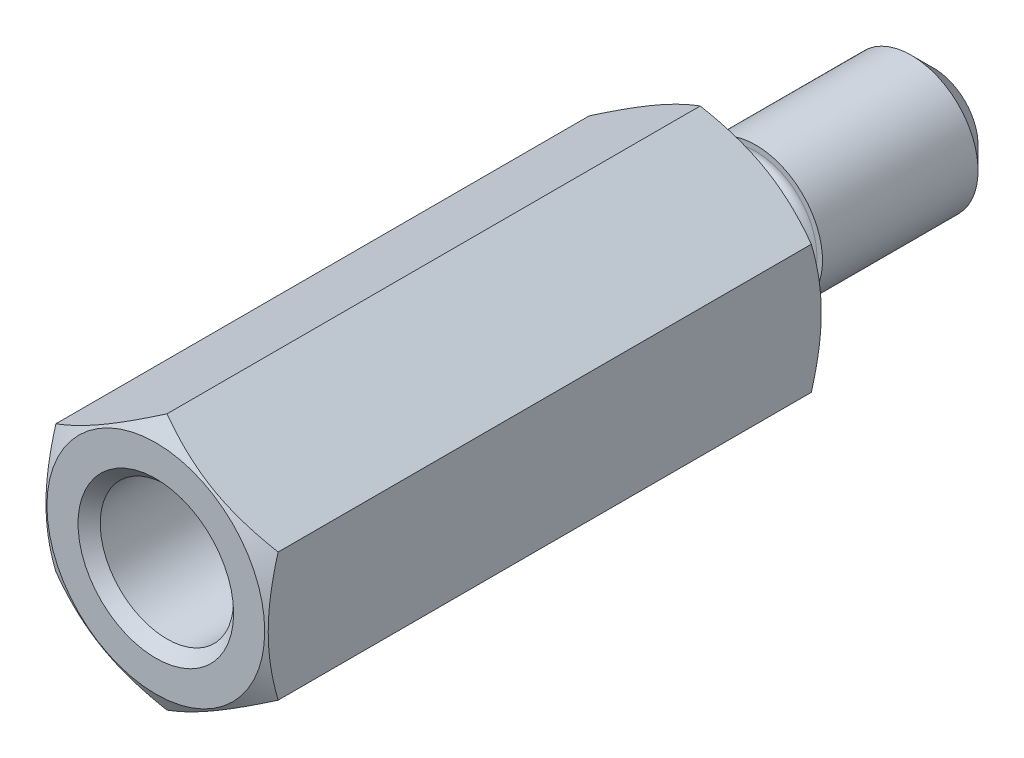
ISO-10303-21;
HEADER;
FILE_DESCRIPTION(('STEP AP214'),'2;1');
FILE_NAME('part.step','',(''),(''),'','','');
FILE_SCHEMA(('AUTOMOTIVE_DESIGN { 1 0 10303 214 1 1 1 1 }'));
ENDSEC;
DATA;
#1=APPLICATION_CONTEXT('core data for automotive mechanical design processes');
#2=APPLICATION_PROTOCOL_DEFINITION('international standard','automotive_design',2000,#1);
#3=PRODUCT_CONTEXT('',#1,'mechanical');
#4=PRODUCT('Part','Part','',(#3));
#5=PRODUCT_RELATED_PRODUCT_CATEGORY('part','',(#4));
#6=PRODUCT_DEFINITION_FORMATION('','',#4);
#7=PRODUCT_DEFINITION_CONTEXT('part definition',#1,'design');
#8=PRODUCT_DEFINITION('design','',#6,#7);
#9=PRODUCT_DEFINITION_SHAPE('','',#8);
#10=(LENGTH_UNIT() NAMED_UNIT(*) SI_UNIT(.MILLI.,.METRE.));
#11=(NAMED_UNIT(*) PLANE_ANGLE_UNIT() SI_UNIT($,.RADIAN.));
#12=(NAMED_UNIT(*) SI_UNIT($,.STERADIAN.) SOLID_ANGLE_UNIT());
#13=UNCERTAINTY_MEASURE_WITH_UNIT(LENGTH_MEASURE(1.E-05),#10,'distance_accuracy_value','');
#14=(GEOMETRIC_REPRESENTATION_CONTEXT(3) GLOBAL_UNCERTAINTY_ASSIGNED_CONTEXT((#13)) GLOBAL_UNIT_ASSIGNED_CONTEXT((#10,
#11,#12)) REPRESENTATION_CONTEXT('',''));
#15=CARTESIAN_POINT('',(0.,0.,0.));
#16=DIRECTION('',(0.,0.,1.));
#17=DIRECTION('',(1.,0.,0.));
#18=AXIS2_PLACEMENT_3D('',#15,#16,#17);
#19=CARTESIAN_POINT('',(0.,-5.77350269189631,0.));
#20=DIRECTION('',(0.,0.,-1.));
#21=DIRECTION('',(-1.,0.,0.));
#22=AXIS2_PLACEMENT_3D('',#19,#20,#21);
#23=PLANE('',#22);
#24=CARTESIAN_POINT('',(0.,0.,0.));
#25=DIRECTION('',(0.,0.,-1.));
#26=DIRECTION('',(-1.,0.,0.));
#27=AXIS2_PLACEMENT_3D('',#24,#25,#26);
#28=CIRCLE('',#27,2.75);
#29=CARTESIAN_POINT('',(-2.75,0.,0.));
#30=VERTEX_POINT('',#29);
#31=EDGE_CURVE('E23',#30,#30,#28,.F.);
#32=ORIENTED_EDGE('',*,*,#31,.T.);
#33=EDGE_LOOP('',(#32));
#34=FACE_BOUND('',#33,.T.);
#35=CARTESIAN_POINT('',(0.,0.,0.));
#36=DIRECTION('',(0.,0.,-1.));
#37=DIRECTION('',(-1.,0.,0.));
#38=AXIS2_PLACEMENT_3D('',#35,#36,#37);
#39=CIRCLE('',#38,4.9);
#40=CARTESIAN_POINT('',(-4.9,0.,0.));
#41=VERTEX_POINT('',#40);
#42=EDGE_CURVE('E73',#41,#41,#39,.T.);
#43=ORIENTED_EDGE('',*,*,#42,.T.);
#44=EDGE_LOOP('',(#43));
#45=FACE_BOUND('',#44,.T.);
#46=ADVANCED_FACE('F14',(#34,#45),#23,.T.);
#47=CARTESIAN_POINT('',(0.,0.,-10.));
#48=DIRECTION('',(0.,0.,1.));
#49=DIRECTION('',(1.,0.,0.));
#50=AXIS2_PLACEMENT_3D('',#47,#48,#49);
#51=CYLINDRICAL_SURFACE('',#50,3.);
#52=CARTESIAN_POINT('',(0.,0.,-2.));
#53=DIRECTION('',(0.,0.,-1.));
#54=DIRECTION('',(-1.,0.,0.));
#55=AXIS2_PLACEMENT_3D('',#52,#53,#54);
#56=CIRCLE('',#55,3.);
#57=CARTESIAN_POINT('',(-3.,0.,-2.));
#58=VERTEX_POINT('',#57);
#59=EDGE_CURVE('E233',#58,#58,#56,.T.);
#60=ORIENTED_EDGE('',*,*,#59,.T.);
#61=EDGE_LOOP('',(#60));
#62=FACE_BOUND('',#61,.T.);
#63=CARTESIAN_POINT('',(0.,0.,-9.));
#64=DIRECTION('',(0.,0.,-1.));
#65=DIRECTION('',(-1.,0.,0.));
#66=AXIS2_PLACEMENT_3D('',#63,#64,#65);
#67=CIRCLE('',#66,3.);
#68=CARTESIAN_POINT('',(-3.,0.,-9.));
#69=VERTEX_POINT('',#68);
#70=EDGE_CURVE('E85',#69,#69,#67,.F.);
#71=ORIENTED_EDGE('',*,*,#70,.T.);
#72=EDGE_LOOP('',(#71));
#73=FACE_BOUND('',#72,.T.);
#74=ADVANCED_FACE('F209',(#62,#73),#51,.T.);
#75=CARTESIAN_POINT('',(0.,0.,-10.));
#76=DIRECTION('',(0.,0.,-1.));
#77=DIRECTION('',(-1.,0.,0.));
#78=AXIS2_PLACEMENT_3D('',#75,#76,#77);
#79=PLANE('',#78);
#80=CARTESIAN_POINT('',(0.,0.,-10.));
#81=DIRECTION('',(0.,0.,-1.));
#82=DIRECTION('',(-1.,0.,0.));
#83=AXIS2_PLACEMENT_3D('',#80,#81,#82);
#84=CIRCLE('',#83,2.);
#85=CARTESIAN_POINT('',(-2.,0.,-10.));
#86=VERTEX_POINT('',#85);
#87=EDGE_CURVE('E82',#86,#86,#84,.T.);
#88=ORIENTED_EDGE('',*,*,#87,.T.);
#89=EDGE_LOOP('',(#88));
#90=FACE_BOUND('',#89,.T.);
#91=ADVANCED_FACE('F213',(#90),#79,.T.);
#92=CARTESIAN_POINT('',(0.,0.,-10.));
#93=DIRECTION('',(0.,0.,1.));
#94=DIRECTION('',(1.,0.,0.));
#95=AXIS2_PLACEMENT_3D('',#92,#93,#94);
#96=CONICAL_SURFACE('',#95,2.,0.78539816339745);
#97=ORIENTED_EDGE('',*,*,#70,.F.);
#98=EDGE_LOOP('',(#97));
#99=FACE_BOUND('',#98,.T.);
#100=ORIENTED_EDGE('',*,*,#87,.F.);
#101=EDGE_LOOP('',(#100));
#102=FACE_BOUND('',#101,.T.);
#103=ADVANCED_FACE('F216',(#99,#102),#96,.T.);
#104=CARTESIAN_POINT('',(0.,0.,-2.));
#105=DIRECTION('',(0.,0.,-1.));
#106=DIRECTION('',(-1.,0.,0.));
#107=AXIS2_PLACEMENT_3D('',#104,#105,#106);
#108=PLANE('',#107);
#109=CARTESIAN_POINT('',(0.,0.,-2.));
#110=DIRECTION('',(0.,0.,-1.));
#111=DIRECTION('',(-1.,0.,0.));
#112=AXIS2_PLACEMENT_3D('',#109,#110,#111);
#113=CIRCLE('',#112,2.75);
#114=CARTESIAN_POINT('',(-2.75,0.,-2.));
#115=VERTEX_POINT('',#114);
#116=EDGE_CURVE('E93',#115,#115,#113,.T.);
#117=ORIENTED_EDGE('',*,*,#116,.T.);
#118=EDGE_LOOP('',(#117));
#119=FACE_BOUND('',#118,.T.);
#120=ORIENTED_EDGE('',*,*,#59,.F.);
#121=EDGE_LOOP('',(#120));
#122=FACE_BOUND('',#121,.T.);
#123=ADVANCED_FACE('F218',(#119,#122),#108,.F.);
#124=CARTESIAN_POINT('',(0.,0.,-2.));
#125=DIRECTION('',(0.,0.,1.));
#126=DIRECTION('',(1.,0.,0.));
#127=AXIS2_PLACEMENT_3D('',#124,#125,#126);
#128=CYLINDRICAL_SURFACE('',#127,2.35);
#129=CARTESIAN_POINT('',(0.,0.,-1.6));
#130=DIRECTION('',(0.,0.,-1.));
#131=DIRECTION('',(-1.,0.,0.));
#132=AXIS2_PLACEMENT_3D('',#129,#130,#131);
#133=CIRCLE('',#132,2.35);
#134=CARTESIAN_POINT('',(-2.35,0.,-1.6));
#135=VERTEX_POINT('',#134);
#136=EDGE_CURVE('E99',#135,#135,#133,.F.);
#137=ORIENTED_EDGE('',*,*,#136,.T.);
#138=EDGE_LOOP('',(#137));
#139=FACE_BOUND('',#138,.T.);
#140=CARTESIAN_POINT('',(0.,0.,-0.4));
#141=DIRECTION('',(0.,0.,-1.));
#142=DIRECTION('',(-1.,0.,0.));
#143=AXIS2_PLACEMENT_3D('',#140,#141,#142);
#144=CIRCLE('',#143,2.35);
#145=CARTESIAN_POINT('',(-2.35,0.,-0.4));
#146=VERTEX_POINT('',#145);
#147=EDGE_CURVE('E96',#146,#146,#144,.T.);
#148=ORIENTED_EDGE('',*,*,#147,.T.);
#149=EDGE_LOOP('',(#148));
#150=FACE_BOUND('',#149,.T.);
#151=ADVANCED_FACE('F121',(#139,#150),#128,.T.);
#152=CARTESIAN_POINT('',(0.,0.,-1.6));
#153=DIRECTION('',(0.,0.,-1.));
#154=DIRECTION('',(-1.,0.,0.));
#155=AXIS2_PLACEMENT_3D('',#152,#153,#154);
#156=TOROIDAL_SURFACE('',#155,2.75,0.4);
#157=ORIENTED_EDGE('',*,*,#136,.F.);
#158=EDGE_LOOP('',(#157));
#159=FACE_BOUND('',#158,.T.);
#160=ORIENTED_EDGE('',*,*,#116,.F.);
#161=EDGE_LOOP('',(#160));
#162=FACE_BOUND('',#161,.T.);
#163=ADVANCED_FACE('F226',(#159,#162),#156,.F.);
#164=CARTESIAN_POINT('',(0.,0.,-0.4));
#165=DIRECTION('',(0.,0.,-1.));
#166=DIRECTION('',(-1.,0.,0.));
#167=AXIS2_PLACEMENT_3D('',#164,#165,#166);
#168=TOROIDAL_SURFACE('',#167,2.75,0.4);
#169=ORIENTED_EDGE('',*,*,#31,.F.);
#170=EDGE_LOOP('',(#169));
#171=FACE_BOUND('',#170,.T.);
#172=ORIENTED_EDGE('',*,*,#147,.F.);
#173=EDGE_LOOP('',(#172));
#174=FACE_BOUND('',#173,.T.);
#175=ADVANCED_FACE('F16',(#171,#174),#168,.F.);
#176=CARTESIAN_POINT('',(0.,0.,0.));
#177=DIRECTION('',(0.,0.,1.));
#178=DIRECTION('',(-1.,0.,0.));
#179=AXIS2_PLACEMENT_3D('',#176,#177,#178);
#180=CONICAL_SURFACE('',#179,4.9,1.0471975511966);
#181=ORIENTED_EDGE('',*,*,#42,.F.);
#182=EDGE_LOOP('',(#181));
#183=FACE_BOUND('',#182,.T.);
#184=CARTESIAN_POINT('',(5.,-28.6841070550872,13.9814764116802));
#185=CARTESIAN_POINT('',(4.99999999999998,-27.7942227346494,13.4753731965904));
#186=CARTESIAN_POINT('',(4.99999999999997,-26.904071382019,12.9697376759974));
#187=CARTESIAN_POINT('',(4.99999999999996,-25.1220022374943,11.9593311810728));
#188=CARTESIAN_POINT('',(4.99999999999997,-24.2300835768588,11.45456173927));
#189=CARTESIAN_POINT('',(4.99999999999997,-22.4259704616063,10.4360738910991));
#190=CARTESIAN_POINT('',(4.99999999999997,-21.5137527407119,9.92239667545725));
#191=CARTESIAN_POINT('',(4.99999999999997,-19.6887187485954,8.89842998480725));
#192=CARTESIAN_POINT('',(4.99999999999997,-18.7759042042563,8.38813743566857));
#193=CARTESIAN_POINT('',(4.99999999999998,-17.2282029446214,7.52765565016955));
#194=CARTESIAN_POINT('',(4.99999999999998,-16.5939321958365,7.1763593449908));
#195=CARTESIAN_POINT('',(4.99999999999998,-15.3238300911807,6.47660272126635));
#196=CARTESIAN_POINT('',(4.99999999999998,-14.6879987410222,6.12814239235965));
#197=CARTESIAN_POINT('',(4.99999999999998,-13.4116880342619,5.43389459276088));
#198=CARTESIAN_POINT('',(4.99999999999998,-12.7712002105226,5.08812264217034));
#199=CARTESIAN_POINT('',(4.99999999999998,-11.8081476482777,4.5740815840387));
#200=CARTESIAN_POINT('',(4.99999999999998,-11.4867997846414,4.40353349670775));
#201=CARTESIAN_POINT('',(4.99999999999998,-10.8430980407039,4.06434784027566));
#202=CARTESIAN_POINT('',(4.99999999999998,-10.5207441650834,3.89571026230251));
#203=CARTESIAN_POINT('',(4.99999999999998,-9.8801483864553,3.56362994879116));
#204=CARTESIAN_POINT('',(4.99999999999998,-9.56192712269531,3.40014745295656));
#205=CARTESIAN_POINT('',(4.99999999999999,-8.9239532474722,3.07617572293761));
#206=CARTESIAN_POINT('',(4.99999999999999,-8.60420060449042,2.91568655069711));
#207=CARTESIAN_POINT('',(4.99999999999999,-7.96228345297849,2.59839481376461));
#208=CARTESIAN_POINT('',(4.99999999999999,-7.64011609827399,2.44159799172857));
#209=CARTESIAN_POINT('',(4.99999999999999,-6.99328627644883,2.13326510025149));
#210=CARTESIAN_POINT('',(4.99999999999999,-6.6686239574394,1.98172872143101));
#211=CARTESIAN_POINT('',(4.99999999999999,-6.01835768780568,1.68689402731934));
#212=CARTESIAN_POINT('',(4.99999999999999,-5.69277704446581,1.54354458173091));
#213=CARTESIAN_POINT('',(4.99999999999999,-5.03729679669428,1.26668676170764));
#214=CARTESIAN_POINT('',(4.99999999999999,-4.70739591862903,1.13318136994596));
#215=CARTESIAN_POINT('',(4.99999999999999,-4.04304329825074,0.880599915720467));
#216=CARTESIAN_POINT('',(4.99999999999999,-3.70860556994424,0.761487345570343));
#217=CARTESIAN_POINT('',(5.,-3.03324419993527,0.54353820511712));
#218=CARTESIAN_POINT('',(5.00000000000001,-2.69232612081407,0.444685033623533));
#219=CARTESIAN_POINT('',(5.,-2.28645576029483,0.345087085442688));
#220=CARTESIAN_POINT('',(4.99999999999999,-2.2248641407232,0.330457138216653));
#221=CARTESIAN_POINT('',(4.99999999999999,-2.1014515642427,0.302164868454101));
#222=CARTESIAN_POINT('',(4.99999999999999,-2.03963058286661,0.288502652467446));
#223=CARTESIAN_POINT('',(4.99999999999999,-1.8538071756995,0.2490422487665));
#224=CARTESIAN_POINT('',(4.99999999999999,-1.72947419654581,0.224777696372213));
#225=CARTESIAN_POINT('',(4.99999999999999,-1.48007058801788,0.180774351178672));
#226=CARTESIAN_POINT('',(4.99999999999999,-1.35500035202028,0.161033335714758));
#227=CARTESIAN_POINT('',(4.99999999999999,-1.10418445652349,0.126453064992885));
#228=CARTESIAN_POINT('',(5.,-0.978438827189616,0.111613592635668));
#229=CARTESIAN_POINT('',(5.,-0.729227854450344,0.0874326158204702));
#230=CARTESIAN_POINT('',(5.,-0.605773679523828,0.0779766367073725));
#231=CARTESIAN_POINT('',(5.,-0.35857721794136,0.0642772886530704));
#232=CARTESIAN_POINT('',(5.,-0.234834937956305,0.0600338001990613));
#233=CARTESIAN_POINT('',(5.,0.0127855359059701,0.0568594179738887));
#234=CARTESIAN_POINT('',(5.,0.136663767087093,0.0579313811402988));
#235=CARTESIAN_POINT('',(5.,0.384263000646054,0.0653669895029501));
#236=CARTESIAN_POINT('',(5.,0.507983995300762,0.0717308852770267));
#237=CARTESIAN_POINT('',(5.,0.801308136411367,0.0929551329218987));
#238=CARTESIAN_POINT('',(5.,0.970749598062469,0.110104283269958));
#239=CARTESIAN_POINT('',(5.,1.3084645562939,0.153428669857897));
#240=CARTESIAN_POINT('',(5.,1.47673791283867,0.179604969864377));
#241=CARTESIAN_POINT('',(5.,1.97944359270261,0.270277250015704));
#242=CARTESIAN_POINT('',(5.,2.31172021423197,0.346913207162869));
#243=CARTESIAN_POINT('',(5.,2.8095759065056,0.481136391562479));
#244=CARTESIAN_POINT('',(5.,2.9776870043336,0.529879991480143));
#245=CARTESIAN_POINT('',(5.,3.31227594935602,0.632733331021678));
#246=CARTESIAN_POINT('',(5.,3.47875378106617,0.686843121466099));
#247=CARTESIAN_POINT('',(5.,3.81015437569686,0.799543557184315));
#248=CARTESIAN_POINT('',(5.,3.97507727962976,0.858133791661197));
#249=CARTESIAN_POINT('',(5.,4.30353082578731,0.979062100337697));
#250=CARTESIAN_POINT('',(5.,4.46706152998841,1.04140000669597));
#251=CARTESIAN_POINT('',(5.,4.82072564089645,1.18013094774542));
#252=CARTESIAN_POINT('',(5.,5.01063031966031,1.25710557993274));
#253=CARTESIAN_POINT('',(5.,5.38898160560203,1.4145662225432));
#254=CARTESIAN_POINT('',(5.,5.5774281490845,1.49505238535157));
#255=CARTESIAN_POINT('',(5.,6.1409585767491,1.74082912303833));
#256=CARTESIAN_POINT('',(5.,6.5141691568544,1.91041228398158));
#257=CARTESIAN_POINT('',(5.00000000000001,7.25716220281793,2.25753370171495));
#258=CARTESIAN_POINT('',(5.00000000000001,7.62694201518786,2.43507758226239));
#259=CARTESIAN_POINT('',(5.00000000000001,8.363721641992,2.79574224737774));
#260=CARTESIAN_POINT('',(5.00000000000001,8.73072171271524,2.97886250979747));
#261=CARTESIAN_POINT('',(5.00000000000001,9.46351758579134,3.34962983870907));
#262=CARTESIAN_POINT('',(5.00000000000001,9.82930845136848,3.53728663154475));
#263=CARTESIAN_POINT('',(5.00000000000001,10.5592980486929,3.9156846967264));
#264=CARTESIAN_POINT('',(5.00000000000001,10.9234967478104,4.10642603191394));
#265=CARTESIAN_POINT('',(5.00000000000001,11.6504952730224,4.49019104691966));
#266=CARTESIAN_POINT('',(5.00000000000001,12.0132956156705,4.68321374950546));
#267=CARTESIAN_POINT('',(5.00000000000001,12.737906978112,5.0711082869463));
#268=CARTESIAN_POINT('',(5.00000000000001,13.099717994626,5.26598012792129));
#269=CARTESIAN_POINT('',(5.00000000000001,14.0755078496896,5.79409076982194));
#270=CARTESIAN_POINT('',(5.00000000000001,14.6887388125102,6.12871089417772));
#271=CARTESIAN_POINT('',(5.00000000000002,15.9136511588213,6.80094300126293));
#272=CARTESIAN_POINT('',(5.00000000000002,16.5253323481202,7.13855533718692));
#273=CARTESIAN_POINT('',(5.00000000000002,17.7448356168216,7.81444800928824));
#274=CARTESIAN_POINT('',(5.00000000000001,18.3526628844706,8.15271899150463));
#275=CARTESIAN_POINT('',(5.00000000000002,19.5673287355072,8.83084551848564));
#276=CARTESIAN_POINT('',(5.00000000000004,20.1741674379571,9.17070084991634));
#277=CARTESIAN_POINT('',(5.00000000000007,20.7806872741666,9.5111209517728));
#278=B_SPLINE_CURVE_WITH_KNOTS('',3,(#184,#185,#186,#187,#188,#189,#190,#191,#192,#193,#194,
#195,#196,#197,#198,#199,#200,#201,#202,#203,#204,#205,#206,#207,#208,#209,#210,#211,#212,#213,
#214,#215,#216,#217,#218,#219,#220,#221,#222,#223,#224,#225,#226,#227,#228,#229,#230,#231,#232,
#233,#234,#235,#236,#237,#238,#239,#240,#241,#242,#243,#244,#245,#246,#247,#248,#249,#250,#251,
#252,#253,#254,#255,#256,#257,#258,#259,#260,#261,#262,#263,#264,#265,#266,#267,#268,#269,#270,
#271,#272,#273,#274,#275,#276,#277),.UNSPECIFIED.,.F.,.F.,(4,2,2,2,2,2,2,2,2,2,2,2,2,2,2,2,2,2,
2,2,2,2,2,2,2,2,2,2,2,2,2,2,2,2,2,2,2,2,2,2,2,2,2,2,2,2,4),(0.,3.07120803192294,
6.14574714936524,9.28645238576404,12.4237456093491,14.5989129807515,16.7740724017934,
18.9576323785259,20.0490302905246,21.1404231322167,22.2136872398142,23.2869735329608,
24.3618315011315,25.4366261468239,26.5037404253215,27.5711767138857,28.6358459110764,
29.6996391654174,29.8895493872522,30.0794804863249,30.4594350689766,30.8392025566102,
31.2189532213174,31.5902943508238,31.9616269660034,32.3331591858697,32.7047089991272,
33.2153458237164,33.7260428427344,34.7475606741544,35.2726170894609,35.7976784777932,
36.322691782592,36.8476815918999,37.4623727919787,38.0770906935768,39.3067335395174,
40.5372591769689,41.7676699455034,43.0010056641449,44.2343665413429,45.4672169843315,
46.7000715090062,48.7958173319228,50.891813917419,52.9786582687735,55.065229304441),.UNSPECIFIED.);
#279=CARTESIAN_POINT('',(5.,2.88675134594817,0.504317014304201));
#280=VERTEX_POINT('',#279);
#281=CARTESIAN_POINT('',(5.,-2.88675134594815,0.504317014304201));
#282=VERTEX_POINT('',#281);
#283=EDGE_CURVE('E30',#280,#282,#278,.F.);
#284=ORIENTED_EDGE('',*,*,#283,.T.);
#285=CARTESIAN_POINT('',(5.0002,-2.88663587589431,0.504383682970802));
#286=CARTESIAN_POINT('',(4.78046540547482,-3.0134997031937,0.431121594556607));
#287=CARTESIAN_POINT('',(4.55885141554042,-3.14144859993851,0.364486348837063));
#288=CARTESIAN_POINT('',(4.11178600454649,-3.39956193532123,0.248174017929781));
#289=CARTESIAN_POINT('',(3.88632664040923,-3.5297309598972,0.19853807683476));
#290=CARTESIAN_POINT('',(3.4381676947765,-3.78847564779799,0.121286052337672));
#291=CARTESIAN_POINT('',(3.21553790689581,-3.91701101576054,0.093155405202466));
#292=CARTESIAN_POINT('',(2.88081009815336,-4.11026620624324,0.0679299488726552));
#293=CARTESIAN_POINT('',(2.76915780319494,-4.17472868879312,0.062348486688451));
#294=CARTESIAN_POINT('',(2.54575002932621,-4.3037132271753,0.0569372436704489));
#295=CARTESIAN_POINT('',(2.4339945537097,-4.36823528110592,0.0571072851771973));
#296=CARTESIAN_POINT('',(2.12781576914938,-4.54500768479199,0.0654886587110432));
#297=CARTESIAN_POINT('',(1.93349391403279,-4.65719946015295,0.0795647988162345));
#298=CARTESIAN_POINT('',(1.54613989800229,-4.88083840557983,0.124200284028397));
#299=CARTESIAN_POINT('',(1.35310909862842,-4.99228478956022,0.154774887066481));
#300=CARTESIAN_POINT('',(0.964974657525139,-5.21637431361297,0.231203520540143));
#301=CARTESIAN_POINT('',(0.769920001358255,-5.32898917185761,0.277381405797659));
#302=CARTESIAN_POINT('',(0.382719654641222,-5.55253939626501,0.38218682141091));
#303=CARTESIAN_POINT('',(0.190569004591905,-5.66347762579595,0.440789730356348));
#304=CARTESIAN_POINT('',(-0.000199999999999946,-5.77361816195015,0.504383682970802));
#305=B_SPLINE_CURVE_WITH_KNOTS('',3,(#285,#286,#287,#288,#289,#290,#291,#292,#293,#294,#295,
#296,#297,#298,#299,#300,#301,#302,#303,#304),.UNSPECIFIED.,.F.,.F.,(4,2,2,2,2,2,2,2,2,4),(0.,
0.792555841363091,1.58701660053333,2.3618153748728,2.74884076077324,3.13585419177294,
3.80962362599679,4.4840172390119,5.17336882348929,5.86136694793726),.UNSPECIFIED.);
#306=CARTESIAN_POINT('',(0.,-5.77350269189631,0.504317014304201));
#307=VERTEX_POINT('',#306);
#308=EDGE_CURVE('E67',#282,#307,#305,.T.);
#309=ORIENTED_EDGE('',*,*,#308,.T.);
#310=CARTESIAN_POINT('',(0.000200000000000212,-5.77361816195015,0.504383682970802));
#311=CARTESIAN_POINT('',(-0.219534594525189,-5.64675433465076,0.431121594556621));
#312=CARTESIAN_POINT('',(-0.441148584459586,-5.51880543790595,0.364486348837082));
#313=CARTESIAN_POINT('',(-0.888213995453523,-5.26069210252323,0.248174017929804));
#314=CARTESIAN_POINT('',(-1.11367335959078,-5.13052307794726,0.19853807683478));
#315=CARTESIAN_POINT('',(-1.56183230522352,-4.87177839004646,0.121286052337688));
#316=CARTESIAN_POINT('',(-1.78446209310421,-4.74324302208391,0.0931554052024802));
#317=CARTESIAN_POINT('',(-2.11918990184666,-4.5499878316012,0.067929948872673));
#318=CARTESIAN_POINT('',(-2.23084219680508,-4.48552534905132,0.062348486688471));
#319=CARTESIAN_POINT('',(-2.45424997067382,-4.35654081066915,0.0569372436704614));
#320=CARTESIAN_POINT('',(-2.56600544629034,-4.29201875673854,0.0571072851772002));
#321=CARTESIAN_POINT('',(-2.87218423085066,-4.11524635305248,0.0654886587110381));
#322=CARTESIAN_POINT('',(-3.06650608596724,-4.0030545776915,0.0795647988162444));
#323=CARTESIAN_POINT('',(-3.45386010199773,-3.77941563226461,0.124200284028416));
#324=CARTESIAN_POINT('',(-3.64689090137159,-3.66796924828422,0.154774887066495));
#325=CARTESIAN_POINT('',(-4.03502534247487,-3.44387972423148,0.231203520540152));
#326=CARTESIAN_POINT('',(-4.23007999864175,-3.33126486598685,0.277381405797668));
#327=CARTESIAN_POINT('',(-4.61728034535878,-3.10771464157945,0.382186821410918));
#328=CARTESIAN_POINT('',(-4.8094309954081,-2.99677641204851,0.440789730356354));
#329=CARTESIAN_POINT('',(-5.0002,-2.88663587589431,0.504383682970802));
#330=B_SPLINE_CURVE_WITH_KNOTS('',3,(#310,#311,#312,#313,#314,#315,#316,#317,#318,#319,#320,
#321,#322,#323,#324,#325,#326,#327,#328,#329),.UNSPECIFIED.,.F.,.F.,(4,2,2,2,2,2,2,2,2,4),(0.,
0.792555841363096,1.58701660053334,2.36181537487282,2.74884076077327,3.13585419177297,
3.80962362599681,4.48401723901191,5.1733688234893,5.86136694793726),.UNSPECIFIED.);
#331=CARTESIAN_POINT('',(-5.,-2.88675134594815,0.504317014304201));
#332=VERTEX_POINT('',#331);
#333=EDGE_CURVE('E69',#307,#332,#330,.T.);
#334=ORIENTED_EDGE('',*,*,#333,.T.);
#335=CARTESIAN_POINT('',(-5.,-28.6841070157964,13.9814763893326));
#336=CARTESIAN_POINT('',(-5.,-27.7942226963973,13.4753731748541));
#337=CARTESIAN_POINT('',(-5.,-26.9040713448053,12.9697376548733));
#338=CARTESIAN_POINT('',(-5.,-25.1220022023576,11.9593311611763));
#339=CARTESIAN_POINT('',(-5.,-24.2300835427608,11.454561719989));
#340=CARTESIAN_POINT('',(-5.,-22.4259704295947,10.4360738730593));
#341=CARTESIAN_POINT('',(-5.,-21.5137527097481,9.9223966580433));
#342=CARTESIAN_POINT('',(-5.,-19.6887187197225,8.89842996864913));
#343=CARTESIAN_POINT('',(-5.,-18.7759041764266,8.38813742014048));
#344=CARTESIAN_POINT('',(-5.,-17.2282029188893,7.52765563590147));
#345=CARTESIAN_POINT('',(-5.,-16.5939321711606,7.17635933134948));
#346=CARTESIAN_POINT('',(-5.,-15.323830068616,6.47660270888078));
#347=CARTESIAN_POINT('',(-5.,-14.6879987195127,6.12814238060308));
#348=CARTESIAN_POINT('',(-5.,-13.4116880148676,5.43389458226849));
#349=CARTESIAN_POINT('',(-5.,-12.7712001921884,5.08812263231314));
#350=CARTESIAN_POINT('',(-5.,-11.8081476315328,4.5740815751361));
#351=CARTESIAN_POINT('',(-5.,-11.4867997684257,4.4035334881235));
#352=CARTESIAN_POINT('',(-5.,-10.8430980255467,4.06434783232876));
#353=CARTESIAN_POINT('',(-5.,-10.5207441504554,3.8957102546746));
#354=CARTESIAN_POINT('',(-5.,-9.88014837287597,3.56362994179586));
#355=CARTESIAN_POINT('',(-5.,-9.56192710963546,3.40014744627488));
#356=CARTESIAN_POINT('',(-5.,-8.92395323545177,3.07617571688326));
#357=CARTESIAN_POINT('',(-5.,-8.60420059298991,2.91568654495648));
#358=CARTESIAN_POINT('',(-5.,-7.96228344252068,2.59839480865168));
#359=CARTESIAN_POINT('',(-5.,-7.64011608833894,2.44159798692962));
#360=CARTESIAN_POINT('',(-5.,-6.99328626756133,2.13326509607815));
#361=CARTESIAN_POINT('',(-5.,-6.66862394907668,1.98172871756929));
#362=CARTESIAN_POINT('',(-5.,-6.01835768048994,1.68689402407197));
#363=CARTESIAN_POINT('',(-5.,-5.69277703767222,1.54354457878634));
#364=CARTESIAN_POINT('',(-5.,-5.03729679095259,1.26668675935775));
#365=CARTESIAN_POINT('',(-5.,-4.70739591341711,1.13318136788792));
#366=CARTESIAN_POINT('',(-5.,-4.04304329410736,0.880599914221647));
#367=CARTESIAN_POINT('',(-5.,-3.70860556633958,0.76148734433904));
#368=CARTESIAN_POINT('',(-5.,-3.03324419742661,0.543538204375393));
#369=CARTESIAN_POINT('',(-5.,-2.69232611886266,0.444685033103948));
#370=CARTESIAN_POINT('',(-5.,-2.28645575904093,0.345087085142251));
#371=CARTESIAN_POINT('',(-5.,-2.22486413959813,0.330457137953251));
#372=CARTESIAN_POINT('',(-5.,-2.10145156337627,0.302164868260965));
#373=CARTESIAN_POINT('',(-5.,-2.03963058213,0.288502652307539));
#374=CARTESIAN_POINT('',(-5.,-1.85380717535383,0.249042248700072));
#375=CARTESIAN_POINT('',(-5.,-1.72947419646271,0.224777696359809));
#376=CARTESIAN_POINT('',(-5.,-1.48007058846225,0.180774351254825));
#377=CARTESIAN_POINT('',(-5.,-1.35500035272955,0.161033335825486));
#378=CARTESIAN_POINT('',(-5.,-1.10418445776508,0.126453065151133));
#379=CARTESIAN_POINT('',(-5.,-0.97843882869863,0.11161359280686));
#380=CARTESIAN_POINT('',(-5.,-0.729227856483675,0.0874326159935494));
#381=CARTESIAN_POINT('',(-5.,-0.605773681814,0.0779766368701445));
#382=CARTESIAN_POINT('',(-5.,-0.358577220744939,0.0642772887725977));
#383=CARTESIAN_POINT('',(-5.,-0.234834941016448,0.0600338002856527));
#384=CARTESIAN_POINT('',(-5.,0.0127855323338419,0.0568594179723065));
#385=CARTESIAN_POINT('',(-5.,0.136663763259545,0.0579313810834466));
#386=CARTESIAN_POINT('',(-5.,0.384262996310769,0.0653669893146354));
#387=CARTESIAN_POINT('',(-5.,0.507983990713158,0.0717308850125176));
#388=CARTESIAN_POINT('',(-5.,0.801308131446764,0.0929551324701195));
#389=CARTESIAN_POINT('',(-5.,0.970749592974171,0.110104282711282));
#390=CARTESIAN_POINT('',(-5.,1.30846455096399,0.153428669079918));
#391=CARTESIAN_POINT('',(-5.,1.47673790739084,0.179604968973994));
#392=CARTESIAN_POINT('',(-5.,1.97944358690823,0.270277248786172));
#393=CARTESIAN_POINT('',(-5.,2.31172020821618,0.346913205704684));
#394=CARTESIAN_POINT('',(-5.,2.80957590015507,0.481136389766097));
#395=CARTESIAN_POINT('',(-5.,2.97768699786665,0.529879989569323));
#396=CARTESIAN_POINT('',(-5.,3.31227594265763,0.632733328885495));
#397=CARTESIAN_POINT('',(-5.,3.47875377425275,0.68684311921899));
#398=CARTESIAN_POINT('',(-5.,3.81015436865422,0.799543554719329));
#399=CARTESIAN_POINT('',(-5.,3.97507727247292,0.858133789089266));
#400=CARTESIAN_POINT('',(-5.,4.30353081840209,0.979062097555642));
#401=CARTESIAN_POINT('',(-5.,4.46706152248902,1.04140000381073));
#402=CARTESIAN_POINT('',(-5.,4.82072563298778,1.18013094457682));
#403=CARTESIAN_POINT('',(-5.,5.01063031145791,1.25710557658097));
#404=CARTESIAN_POINT('',(-5.,5.38898159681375,1.41456621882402));
#405=CARTESIAN_POINT('',(-5.,5.57742814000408,1.49505238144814));
#406=CARTESIAN_POINT('',(-5.,6.14095856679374,1.74082911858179));
#407=CARTESIAN_POINT('',(-5.,6.51416914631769,1.91041227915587));
#408=CARTESIAN_POINT('',(-5.,7.25716219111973,2.25753369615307));
#409=CARTESIAN_POINT('',(-5.,7.62694200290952,2.43507757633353));
#410=CARTESIAN_POINT('',(-5.,8.36372162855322,2.79574224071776));
#411=CARTESIAN_POINT('',(-5.,8.73072169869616,2.97886250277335));
#412=CARTESIAN_POINT('',(-5.,9.46351757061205,3.34962983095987));
#413=CARTESIAN_POINT('',(-5.,9.82930843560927,3.53728662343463));
#414=CARTESIAN_POINT('',(-5.,10.559298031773,3.91568468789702));
#415=CARTESIAN_POINT('',(-5.,10.9234967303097,4.10642602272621));
#416=CARTESIAN_POINT('',(-5.,11.6504952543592,4.49019103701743));
#417=CARTESIAN_POINT('',(-5.,12.0132955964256,4.68321373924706));
#418=CARTESIAN_POINT('',(-5.,12.7379069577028,5.07110827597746));
#419=CARTESIAN_POINT('',(-5.,13.0997179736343,5.26598011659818));
#420=CARTESIAN_POINT('',(-5.,14.0755078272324,5.79409075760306));
#421=CARTESIAN_POINT('',(-5.,14.688738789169,6.12871088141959));
#422=CARTESIAN_POINT('',(-5.,15.9136511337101,6.8009429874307));
#423=CARTESIAN_POINT('',(-5.,16.5253323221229,7.13855532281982));
#424=CARTESIAN_POINT('',(-5.,17.7448355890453,7.81444799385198));
#425=CARTESIAN_POINT('',(-5.,18.3526628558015,8.15271897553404));
#426=CARTESIAN_POINT('',(-5.,19.5673287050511,8.83084550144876));
#427=CARTESIAN_POINT('',(-5.,20.1741674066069,9.1707008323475));
#428=CARTESIAN_POINT('',(-5.,20.7806872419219,9.51112093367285));
#429=B_SPLINE_CURVE_WITH_KNOTS('',3,(#335,#336,#337,#338,#339,#340,#341,#342,#343,#344,#345,
#346,#347,#348,#349,#350,#351,#352,#353,#354,#355,#356,#357,#358,#359,#360,#361,#362,#363,#364,
#365,#366,#367,#368,#369,#370,#371,#372,#373,#374,#375,#376,#377,#378,#379,#380,#381,#382,#383,
#384,#385,#386,#387,#388,#389,#390,#391,#392,#393,#394,#395,#396,#397,#398,#399,#400,#401,#402,
#403,#404,#405,#406,#407,#408,#409,#410,#411,#412,#413,#414,#415,#416,#417,#418,#419,#420,#421,
#422,#423,#424,#425,#426,#427,#428),.UNSPECIFIED.,.F.,.F.,(4,2,2,2,2,2,2,2,2,2,2,2,2,2,2,2,2,2,
2,2,2,2,2,2,2,2,2,2,2,2,2,2,2,2,2,2,2,2,2,2,2,2,2,2,2,2,4),(0.,3.07120802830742,6.1457471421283,
9.28645237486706,12.4237455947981,14.5989129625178,16.774072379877,18.9576323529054,
20.0490302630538,21.1404231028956,22.2136872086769,23.2869735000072,24.3618314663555,
25.436626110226,26.5037403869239,27.5711766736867,28.6358458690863,29.6996391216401,
29.8895493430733,30.0794804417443,30.4594350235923,30.8392025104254,31.218953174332,
31.5902943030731,31.9616269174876,32.3331591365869,32.7047089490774,33.2153457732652,
33.726042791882,34.7475606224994,35.2726170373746,35.7976784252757,36.3226917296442,
36.8476815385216,37.4623727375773,38.0770906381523,39.3067334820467,40.5372591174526,
41.7676698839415,43.0010056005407,44.2343664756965,45.4672169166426,46.7000714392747,
48.7958172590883,50.8918138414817,52.9786581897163,55.0652292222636),.UNSPECIFIED.);
#430=CARTESIAN_POINT('',(-5.,2.88675134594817,0.504317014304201));
#431=VERTEX_POINT('',#430);
#432=EDGE_CURVE('E78',#332,#431,#429,.T.);
#433=ORIENTED_EDGE('',*,*,#432,.T.);
#434=CARTESIAN_POINT('',(-5.0002,2.88663587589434,0.504383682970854));
#435=CARTESIAN_POINT('',(-4.78046540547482,3.01349970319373,0.431121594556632));
#436=CARTESIAN_POINT('',(-4.55885141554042,3.14144859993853,0.364486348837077));
#437=CARTESIAN_POINT('',(-4.11178600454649,3.39956193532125,0.248174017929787));
#438=CARTESIAN_POINT('',(-3.88632664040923,3.52973095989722,0.198538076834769));
#439=CARTESIAN_POINT('',(-3.43816769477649,3.78847564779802,0.121286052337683));
#440=CARTESIAN_POINT('',(-3.21553790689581,3.91701101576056,0.0931554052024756));
#441=CARTESIAN_POINT('',(-2.88081009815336,4.11026620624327,0.067929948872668));
#442=CARTESIAN_POINT('',(-2.76915780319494,4.17472868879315,0.0623484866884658));
#443=CARTESIAN_POINT('',(-2.54575002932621,4.30371322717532,0.0569372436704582));
#444=CARTESIAN_POINT('',(-2.4339945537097,4.36823528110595,0.0571072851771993));
#445=CARTESIAN_POINT('',(-2.12781576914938,4.54500768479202,0.0654886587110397));
#446=CARTESIAN_POINT('',(-1.93349391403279,4.65719946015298,0.0795647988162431));
#447=CARTESIAN_POINT('',(-1.54613989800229,4.88083840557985,0.124200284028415));
#448=CARTESIAN_POINT('',(-1.35310909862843,4.99228478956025,0.154774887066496));
#449=CARTESIAN_POINT('',(-0.964974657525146,5.216374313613,0.231203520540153));
#450=CARTESIAN_POINT('',(-0.769920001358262,5.32898917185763,0.277381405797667));
#451=CARTESIAN_POINT('',(-0.38271965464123,5.55253939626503,0.382186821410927));
#452=CARTESIAN_POINT('',(-0.190569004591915,5.66347762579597,0.440789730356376));
#453=CARTESIAN_POINT('',(0.000199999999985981,5.77361816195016,0.504383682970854));
#454=B_SPLINE_CURVE_WITH_KNOTS('',3,(#434,#435,#436,#437,#438,#439,#440,#441,#442,#443,#444,
#445,#446,#447,#448,#449,#450,#451,#452,#453),.UNSPECIFIED.,.F.,.F.,(4,2,2,2,2,2,2,2,2,4),(0.,
0.792555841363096,1.58701660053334,2.36181537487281,2.74884076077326,3.13585419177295,
3.8096236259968,4.4840172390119,5.1733688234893,5.86136694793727),.UNSPECIFIED.);
#455=CARTESIAN_POINT('',(0.,5.77350269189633,0.504317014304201));
#456=VERTEX_POINT('',#455);
#457=EDGE_CURVE('E175',#431,#456,#454,.T.);
#458=ORIENTED_EDGE('',*,*,#457,.T.);
#459=CARTESIAN_POINT('',(-0.000200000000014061,5.77361816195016,0.504383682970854));
#460=CARTESIAN_POINT('',(0.219534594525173,5.64675433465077,0.431121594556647));
#461=CARTESIAN_POINT('',(0.441148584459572,5.51880543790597,0.364486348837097));
#462=CARTESIAN_POINT('',(0.88821399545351,5.26069210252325,0.24817401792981));
#463=CARTESIAN_POINT('',(1.11367335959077,5.13052307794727,0.198538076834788));
#464=CARTESIAN_POINT('',(1.56183230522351,4.87177839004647,0.121286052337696));
#465=CARTESIAN_POINT('',(1.7844620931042,4.74324302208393,0.0931554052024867));
#466=CARTESIAN_POINT('',(2.11918990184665,4.54998783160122,0.0679299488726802));
#467=CARTESIAN_POINT('',(2.23084219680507,4.48552534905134,0.062348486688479));
#468=CARTESIAN_POINT('',(2.45424997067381,4.35654081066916,0.0569372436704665));
#469=CARTESIAN_POINT('',(2.56600544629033,4.29201875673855,0.0571072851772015));
#470=CARTESIAN_POINT('',(2.87218423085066,4.11524635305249,0.0654886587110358));
#471=CARTESIAN_POINT('',(3.06650608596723,4.00305457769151,0.0795647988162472));
#472=CARTESIAN_POINT('',(3.45386010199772,3.77941563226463,0.124200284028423));
#473=CARTESIAN_POINT('',(3.64689090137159,3.66796924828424,0.1547748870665));
#474=CARTESIAN_POINT('',(4.03502534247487,3.4438797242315,0.231203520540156));
#475=CARTESIAN_POINT('',(4.23007999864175,3.33126486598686,0.277381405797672));
#476=CARTESIAN_POINT('',(4.61728034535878,3.10771464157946,0.382186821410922));
#477=CARTESIAN_POINT('',(4.80943099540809,2.99677641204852,0.440789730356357));
#478=CARTESIAN_POINT('',(5.0002,2.88663587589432,0.504383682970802));
#479=B_SPLINE_CURVE_WITH_KNOTS('',3,(#459,#460,#461,#462,#463,#464,#465,#466,#467,#468,#469,
#470,#471,#472,#473,#474,#475,#476,#477,#478),.UNSPECIFIED.,.F.,.F.,(4,2,2,2,2,2,2,2,2,4),(0.,
0.792555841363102,1.58701660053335,2.36181537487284,2.74884076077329,3.13585419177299,
3.80962362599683,4.48401723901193,5.17336882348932,5.86136694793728),.UNSPECIFIED.);
#480=EDGE_CURVE('E182',#456,#280,#479,.T.);
#481=ORIENTED_EDGE('',*,*,#480,.T.);
#482=EDGE_LOOP('',(#284,#309,#334,#433,#458,#481));
#483=FACE_BOUND('',#482,.T.);
#484=ADVANCED_FACE('F68',(#183,#483),#180,.T.);
#485=CARTESIAN_POINT('',(0.,-5.77350269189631,25.));
#486=DIRECTION('',(0.,0.,-1.));
#487=DIRECTION('',(-1.,0.,0.));
#488=AXIS2_PLACEMENT_3D('',#485,#486,#487);
#489=PLANE('',#488);
#490=CARTESIAN_POINT('',(0.,0.,25.));
#491=DIRECTION('',(0.,0.,1.));
#492=DIRECTION('',(1.,0.,0.));
#493=AXIS2_PLACEMENT_3D('',#490,#491,#492);
#494=CIRCLE('',#493,3.5);
#495=CARTESIAN_POINT('',(3.5,0.,25.));
#496=VERTEX_POINT('',#495);
#497=EDGE_CURVE('E406',#496,#496,#494,.T.);
#498=ORIENTED_EDGE('',*,*,#497,.F.);
#499=EDGE_LOOP('',(#498));
#500=FACE_BOUND('',#499,.T.);
#501=CARTESIAN_POINT('',(0.,0.,25.));
#502=DIRECTION('',(0.,0.,1.));
#503=DIRECTION('',(1.,0.,0.));
#504=AXIS2_PLACEMENT_3D('',#501,#502,#503);
#505=CIRCLE('',#504,4.9);
#506=CARTESIAN_POINT('',(4.9,0.,25.));
#507=VERTEX_POINT('',#506);
#508=EDGE_CURVE('E196',#507,#507,#505,.T.);
#509=ORIENTED_EDGE('',*,*,#508,.T.);
#510=EDGE_LOOP('',(#509));
#511=FACE_BOUND('',#510,.T.);
#512=ADVANCED_FACE('F117',(#500,#511),#489,.F.);
#513=CARTESIAN_POINT('',(0.,0.,25.));
#514=DIRECTION('',(0.,0.,-1.));
#515=DIRECTION('',(1.,0.,0.));
#516=AXIS2_PLACEMENT_3D('',#513,#514,#515);
#517=CONICAL_SURFACE('',#516,4.9,1.0471975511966);
#518=ORIENTED_EDGE('',*,*,#508,.F.);
#519=EDGE_LOOP('',(#518));
#520=FACE_BOUND('',#519,.T.);
#521=CARTESIAN_POINT('',(5.,-28.4550073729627,11.1488140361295));
#522=CARTESIAN_POINT('',(4.99999999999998,-27.5678584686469,11.6532400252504));
#523=CARTESIAN_POINT('',(4.99999999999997,-26.6804382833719,12.157190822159));
#524=CARTESIAN_POINT('',(4.99999999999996,-24.9037757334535,13.1642240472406));
#525=CARTESIAN_POINT('',(4.99999999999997,-24.0145324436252,13.6673048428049));
#526=CARTESIAN_POINT('',(4.99999999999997,-22.214782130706,14.6829174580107));
#527=CARTESIAN_POINT('',(4.99999999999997,-21.3042500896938,15.1954049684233));
#528=CARTESIAN_POINT('',(4.99999999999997,-19.4825919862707,16.2168961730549));
#529=CARTESIAN_POINT('',(4.99999999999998,-18.5714677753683,16.7259031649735));
#530=CARTESIAN_POINT('',(4.99999999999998,-17.0305066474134,17.5819191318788));
#531=CARTESIAN_POINT('',(4.99999999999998,-16.4013101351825,17.930080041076));
#532=CARTESIAN_POINT('',(4.99999999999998,-15.1413318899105,18.6235179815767));
#533=CARTESIAN_POINT('',(4.99999999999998,-14.5105501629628,18.9687950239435));
#534=CARTESIAN_POINT('',(4.99999999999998,-13.2442153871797,19.6566511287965));
#535=CARTESIAN_POINT('',(4.99999999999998,-12.6086533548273,19.9992137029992));
#536=CARTESIAN_POINT('',(4.99999999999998,-11.652950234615,20.5083521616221));
#537=CARTESIAN_POINT('',(4.99999999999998,-11.3340469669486,20.6772506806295));
#538=CARTESIAN_POINT('',(4.99999999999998,-10.6952168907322,21.0130994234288));
#539=CARTESIAN_POINT('',(4.99999999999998,-10.3752900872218,21.1800496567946));
#540=CARTESIAN_POINT('',(4.99999999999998,-9.73974081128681,21.5086028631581));
#541=CARTESIAN_POINT('',(4.99999999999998,-9.42414033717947,21.6702483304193));
#542=CARTESIAN_POINT('',(4.99999999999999,-8.79138383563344,21.9904884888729));
#543=CARTESIAN_POINT('',(4.99999999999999,-8.47422777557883,22.1490831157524));
#544=CARTESIAN_POINT('',(4.99999999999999,-7.83746144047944,22.4625141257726));
#545=CARTESIAN_POINT('',(4.99999999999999,-7.51784817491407,22.6173444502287));
#546=CARTESIAN_POINT('',(4.99999999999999,-6.87608954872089,22.9216394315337));
#547=CARTESIAN_POINT('',(4.99999999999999,-6.55394433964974,23.0711044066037));
#548=CARTESIAN_POINT('',(4.99999999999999,-5.90874723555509,23.36162462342));
#549=CARTESIAN_POINT('',(4.99999999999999,-5.58571993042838,23.5027341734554));
#550=CARTESIAN_POINT('',(4.99999999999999,-4.93530386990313,23.7749257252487));
#551=CARTESIAN_POINT('',(4.99999999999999,-4.60791380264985,23.9060046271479));
#552=CARTESIAN_POINT('',(4.99999999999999,-3.94858163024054,24.153483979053));
#553=CARTESIAN_POINT('',(4.99999999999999,-3.61665411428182,24.2699229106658));
#554=CARTESIAN_POINT('',(5.,-2.94634662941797,24.4822431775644));
#555=CARTESIAN_POINT('',(5.00000000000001,-2.60797236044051,24.5781418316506));
#556=CARTESIAN_POINT('',(5.,-2.20500973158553,24.6741802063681));
#557=CARTESIAN_POINT('',(4.99999999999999,-2.14370448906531,24.6883020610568));
#558=CARTESIAN_POINT('',(4.99999999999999,-2.02086907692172,24.7155673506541));
#559=CARTESIAN_POINT('',(4.99999999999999,-1.95933888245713,24.7287106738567));
#560=CARTESIAN_POINT('',(4.99999999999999,-1.77439443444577,24.7665994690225));
#561=CARTESIAN_POINT('',(4.99999999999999,-1.65065796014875,24.7897961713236));
#562=CARTESIAN_POINT('',(4.99999999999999,-1.40247703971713,24.8316360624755));
#563=CARTESIAN_POINT('',(4.99999999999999,-1.27803296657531,24.8502814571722));
#564=CARTESIAN_POINT('',(4.99999999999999,-1.02850844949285,24.8826595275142));
#565=CARTESIAN_POINT('',(5.,-0.903428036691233,24.8963924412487));
#566=CARTESIAN_POINT('',(5.,-0.655527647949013,24.9184009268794));
#567=CARTESIAN_POINT('',(5.,-0.532717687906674,24.9267887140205));
#568=CARTESIAN_POINT('',(5.,-0.286854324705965,24.9383834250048));
#569=CARTESIAN_POINT('',(5.,-0.163800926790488,24.9415904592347));
#570=CARTESIAN_POINT('',(5.,0.0823997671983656,24.9427482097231));
#571=CARTESIAN_POINT('',(5.,0.205547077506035,24.9406960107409));
#572=CARTESIAN_POINT('',(5.,0.451646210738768,24.931379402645));
#573=CARTESIAN_POINT('',(5.,0.57459802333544,24.9241147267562));
#574=CARTESIAN_POINT('',(5.,0.869109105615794,24.9006240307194));
#575=CARTESIAN_POINT('',(5.,1.04047959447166,24.8819783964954));
#576=CARTESIAN_POINT('',(5.,1.38197103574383,24.83556416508));
#577=CARTESIAN_POINT('',(5.,1.5520918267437,24.8077944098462));
#578=CARTESIAN_POINT('',(5.,2.06024596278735,24.7122874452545));
#579=CARTESIAN_POINT('',(5.,2.3960191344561,24.6323572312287));
#580=CARTESIAN_POINT('',(5.,2.89908038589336,24.4932424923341));
#581=CARTESIAN_POINT('',(5.,3.06894892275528,24.4428529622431));
#582=CARTESIAN_POINT('',(5.,3.40703204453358,24.3367513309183));
#583=CARTESIAN_POINT('',(5.,3.57524661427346,24.2810391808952));
#584=CARTESIAN_POINT('',(5.,3.91010647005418,24.1651857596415));
#585=CARTESIAN_POINT('',(5.,4.07675194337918,24.105045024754));
#586=CARTESIAN_POINT('',(5.,4.40864919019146,23.9810650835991));
#587=CARTESIAN_POINT('',(5.,4.57390102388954,23.917226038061));
#588=CARTESIAN_POINT('',(5.,4.93338579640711,23.7744604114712));
#589=CARTESIAN_POINT('',(5.,5.12737231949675,23.6949148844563));
#590=CARTESIAN_POINT('',(5.,5.5138668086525,23.5323018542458));
#591=CARTESIAN_POINT('',(5.,5.70637471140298,23.4492342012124));
#592=CARTESIAN_POINT('',(5.,6.28207085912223,23.1957134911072));
#593=CARTESIAN_POINT('',(5.,6.66336780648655,23.0209685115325));
#594=CARTESIAN_POINT('',(5.00000000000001,7.42252012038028,22.6635619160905));
#595=CARTESIAN_POINT('',(5.00000000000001,7.80037291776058,22.4808948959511));
#596=CARTESIAN_POINT('',(5.00000000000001,8.55330355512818,22.1100283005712));
#597=CARTESIAN_POINT('',(5.00000000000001,8.92838164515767,21.9218292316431));
#598=CARTESIAN_POINT('',(5.00000000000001,9.67732931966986,21.5409518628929));
#599=CARTESIAN_POINT('',(5.00000000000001,10.051194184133,21.348264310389));
#600=CARTESIAN_POINT('',(5.00000000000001,10.7973447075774,20.9598423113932));
#601=CARTESIAN_POINT('',(5.00000000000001,11.1696303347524,20.7641078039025));
#602=CARTESIAN_POINT('',(5.00000000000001,11.9128171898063,20.3703878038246));
#603=CARTESIAN_POINT('',(5.00000000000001,12.2837189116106,20.1724032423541));
#604=CARTESIAN_POINT('',(5.00000000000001,13.0245445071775,19.7746120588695));
#605=CARTESIAN_POINT('',(5.00000000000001,13.3944683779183,19.5748054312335));
#606=CARTESIAN_POINT('',(5.00000000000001,14.3913925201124,19.033827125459));
#607=CARTESIAN_POINT('',(5.00000000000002,15.0176574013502,18.6913007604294));
#608=CARTESIAN_POINT('',(5.00000000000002,16.2686639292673,18.0033118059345));
#609=CARTESIAN_POINT('',(5.00000000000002,16.8934053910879,17.6578488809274));
#610=CARTESIAN_POINT('',(5.00000000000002,18.1391174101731,16.9662615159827));
#611=CARTESIAN_POINT('',(5.00000000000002,18.760092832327,16.6201458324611));
#612=CARTESIAN_POINT('',(5.00000000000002,20.0010723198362,15.926360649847));
#613=CARTESIAN_POINT('',(5.00000000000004,20.6210764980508,15.5786913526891));
#614=CARTESIAN_POINT('',(5.00000000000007,21.2407678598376,15.2304685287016));
#615=B_SPLINE_CURVE_WITH_KNOTS('',3,(#521,#522,#523,#524,#525,#526,#527,#528,#529,#530,#531,
#532,#533,#534,#535,#536,#537,#538,#539,#540,#541,#542,#543,#544,#545,#546,#547,#548,#549,#550,
#551,#552,#553,#554,#555,#556,#557,#558,#559,#560,#561,#562,#563,#564,#565,#566,#567,#568,#569,
#570,#571,#572,#573,#574,#575,#576,#577,#578,#579,#580,#581,#582,#583,#584,#585,#586,#587,#588,
#589,#590,#591,#592,#593,#594,#595,#596,#597,#598,#599,#600,#601,#602,#603,#604,#605,#606,#607,
#608,#609,#610,#611,#612,#613,#614),.UNSPECIFIED.,.F.,.F.,(4,2,2,2,2,2,2,2,2,2,2,2,2,2,2,2,2,2,
2,2,2,2,2,2,2,2,2,2,2,2,2,2,2,2,2,2,2,2,2,2,2,2,2,2,2,2,4),(0.,3.06158730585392,
6.12664617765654,9.26119364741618,12.3921783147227,14.5494716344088,16.7067566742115,
18.872738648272,19.9553388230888,21.0379336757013,22.1016862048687,23.1654611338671,
24.23084791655,25.2961714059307,26.3535665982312,27.4112872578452,28.4661668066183,
29.5201533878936,29.7088797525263,29.8976276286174,30.2752209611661,30.6526309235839,
31.0300225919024,31.3992048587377,31.7683792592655,32.1377583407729,32.507156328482,
33.0240120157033,33.5409333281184,34.5749316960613,35.1064394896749,35.6379521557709,
36.169400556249,36.7008258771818,37.3297685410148,37.9587379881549,39.2168831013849,
40.4759004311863,41.7348028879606,42.9965820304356,44.2583864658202,45.5196864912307,
46.7809904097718,48.9224233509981,51.0641043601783,53.1968601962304,55.3293464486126),.UNSPECIFIED.);
#616=CARTESIAN_POINT('',(5.,-2.88675134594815,24.4956829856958));
#617=VERTEX_POINT('',#616);
#618=CARTESIAN_POINT('',(5.,2.88675134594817,24.4956829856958));
#619=VERTEX_POINT('',#618);
#620=EDGE_CURVE('E126',#617,#619,#615,.T.);
#621=ORIENTED_EDGE('',*,*,#620,.T.);
#622=CARTESIAN_POINT('',(5.0002,2.88663587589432,24.4956163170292));
#623=CARTESIAN_POINT('',(4.78046540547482,3.01349970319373,24.5688784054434));
#624=CARTESIAN_POINT('',(4.55885141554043,3.14144859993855,24.6355136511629));
#625=CARTESIAN_POINT('',(4.1117860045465,3.39956193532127,24.7518259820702));
#626=CARTESIAN_POINT('',(3.88632664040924,3.52973095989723,24.8014619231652));
#627=CARTESIAN_POINT('',(3.43816769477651,3.78847564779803,24.8787139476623));
#628=CARTESIAN_POINT('',(3.21553790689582,3.91701101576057,24.9068445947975));
#629=CARTESIAN_POINT('',(2.88081009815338,4.11026620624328,24.9320700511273));
#630=CARTESIAN_POINT('',(2.76915780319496,4.17472868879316,24.9376515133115));
#631=CARTESIAN_POINT('',(2.54575002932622,4.30371322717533,24.9430627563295));
#632=CARTESIAN_POINT('',(2.43399455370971,4.36823528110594,24.9428927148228));
#633=CARTESIAN_POINT('',(2.12781576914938,4.545007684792,24.934511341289));
#634=CARTESIAN_POINT('',(1.9334939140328,4.65719946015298,24.9204352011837));
#635=CARTESIAN_POINT('',(1.5461398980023,4.88083840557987,24.8757997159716));
#636=CARTESIAN_POINT('',(1.35310909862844,4.99228478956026,24.8452251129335));
#637=CARTESIAN_POINT('',(0.964974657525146,5.21637431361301,24.7687964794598));
#638=CARTESIAN_POINT('',(0.769920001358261,5.32898917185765,24.7226185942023));
#639=CARTESIAN_POINT('',(0.382719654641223,5.55253939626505,24.6178131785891));
#640=CARTESIAN_POINT('',(0.190569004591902,5.66347762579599,24.5592102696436));
#641=CARTESIAN_POINT('',(-0.000200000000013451,5.77361816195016,24.4956163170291));
#642=B_SPLINE_CURVE_WITH_KNOTS('',3,(#622,#623,#624,#625,#626,#627,#628,#629,#630,#631,#632,
#633,#634,#635,#636,#637,#638,#639,#640,#641),.UNSPECIFIED.,.F.,.F.,(4,2,2,2,2,2,2,2,2,4),(0.,
0.792555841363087,1.58701660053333,2.36181537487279,2.74884076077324,3.13585419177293,
3.80962362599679,4.4840172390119,5.1733688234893,5.86136694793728),.UNSPECIFIED.);
#643=CARTESIAN_POINT('',(0.,5.77350269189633,24.4956829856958));
#644=VERTEX_POINT('',#643);
#645=EDGE_CURVE('E159',#619,#644,#642,.T.);
#646=ORIENTED_EDGE('',*,*,#645,.T.);
#647=CARTESIAN_POINT('',(0.000199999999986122,5.77361816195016,24.4956163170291));
#648=CARTESIAN_POINT('',(-0.219534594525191,5.64675433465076,24.5688784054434));
#649=CARTESIAN_POINT('',(-0.441148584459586,5.51880543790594,24.6355136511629));
#650=CARTESIAN_POINT('',(-0.888213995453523,5.26069210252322,24.7518259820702));
#651=CARTESIAN_POINT('',(-1.11367335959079,5.13052307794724,24.8014619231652));
#652=CARTESIAN_POINT('',(-1.56183230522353,4.87177839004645,24.8787139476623));
#653=CARTESIAN_POINT('',(-1.78446209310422,4.7432430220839,24.9068445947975));
#654=CARTESIAN_POINT('',(-2.11918990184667,4.54998783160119,24.9320700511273));
#655=CARTESIAN_POINT('',(-2.23084219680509,4.4855253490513,24.9376515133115));
#656=CARTESIAN_POINT('',(-2.45424997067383,4.35654081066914,24.9430627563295));
#657=CARTESIAN_POINT('',(-2.56600544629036,4.29201875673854,24.9428927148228));
#658=CARTESIAN_POINT('',(-2.87218423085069,4.1152463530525,24.934511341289));
#659=CARTESIAN_POINT('',(-3.06650608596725,4.0030545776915,24.9204352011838));
#660=CARTESIAN_POINT('',(-3.45386010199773,3.7794156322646,24.8757997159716));
#661=CARTESIAN_POINT('',(-3.64689090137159,3.66796924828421,24.8452251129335));
#662=CARTESIAN_POINT('',(-4.03502534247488,3.44387972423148,24.7687964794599));
#663=CARTESIAN_POINT('',(-4.23007999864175,3.33126486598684,24.7226185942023));
#664=CARTESIAN_POINT('',(-4.61728034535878,3.10771464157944,24.6178131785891));
#665=CARTESIAN_POINT('',(-4.80943099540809,2.99677641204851,24.5592102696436));
#666=CARTESIAN_POINT('',(-5.0002,2.88663587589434,24.4956163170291));
#667=B_SPLINE_CURVE_WITH_KNOTS('',3,(#647,#648,#649,#650,#651,#652,#653,#654,#655,#656,#657,
#658,#659,#660,#661,#662,#663,#664,#665,#666),.UNSPECIFIED.,.F.,.F.,(4,2,2,2,2,2,2,2,2,4),(0.,
0.792555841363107,1.58701660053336,2.36181537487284,2.74884076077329,3.135854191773,
3.80962362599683,4.48401723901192,5.17336882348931,5.86136694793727),.UNSPECIFIED.);
#668=CARTESIAN_POINT('',(-5.,2.88675134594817,24.4956829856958));
#669=VERTEX_POINT('',#668);
#670=EDGE_CURVE('E152',#644,#669,#667,.T.);
#671=ORIENTED_EDGE('',*,*,#670,.T.);
#672=CARTESIAN_POINT('',(-5.,-28.45500736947,11.1488140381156));
#673=CARTESIAN_POINT('',(-5.,-27.567858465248,11.6532400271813));
#674=CARTESIAN_POINT('',(-5.,-26.6804382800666,12.1571908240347));
#675=CARTESIAN_POINT('',(-5.,-24.9037757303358,13.1642240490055));
#676=CARTESIAN_POINT('',(-5.,-24.0145324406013,13.6673048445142));
#677=CARTESIAN_POINT('',(-5.,-22.2147821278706,14.6829174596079));
#678=CARTESIAN_POINT('',(-5.,-21.3042500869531,15.1954049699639));
#679=CARTESIAN_POINT('',(-5.,-19.4825919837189,16.216896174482));
#680=CARTESIAN_POINT('',(-5.,-18.5714677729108,16.7259031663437));
#681=CARTESIAN_POINT('',(-5.,-17.0305066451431,17.5819191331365));
#682=CARTESIAN_POINT('',(-5.,-16.4013101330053,17.9300800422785));
#683=CARTESIAN_POINT('',(-5.,-15.1413318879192,18.6235179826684));
#684=CARTESIAN_POINT('',(-5.,-14.5105501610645,18.9687950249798));
#685=CARTESIAN_POINT('',(-5.,-13.2442153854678,19.6566511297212));
#686=CARTESIAN_POINT('',(-5.,-12.6086533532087,19.9992137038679));
#687=CARTESIAN_POINT('',(-5.,-11.6529502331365,20.5083521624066));
#688=CARTESIAN_POINT('',(-5.,-11.3340469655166,20.6772506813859));
#689=CARTESIAN_POINT('',(-5.,-10.6952168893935,21.0130994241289));
#690=CARTESIAN_POINT('',(-5.,-10.3752900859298,21.1800496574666));
#691=CARTESIAN_POINT('',(-5.,-9.73974081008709,21.5086028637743));
#692=CARTESIAN_POINT('',(-5.,-9.42414033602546,21.6702483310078));
#693=CARTESIAN_POINT('',(-5.,-8.79138383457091,21.9904884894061));
#694=CARTESIAN_POINT('',(-5.,-8.47422777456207,22.149083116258));
#695=CARTESIAN_POINT('',(-5.,-7.83746143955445,22.4625141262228));
#696=CARTESIAN_POINT('',(-5.,-7.51784817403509,22.6173444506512));
#697=CARTESIAN_POINT('',(-5.,-6.87608954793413,22.921639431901));
#698=CARTESIAN_POINT('',(-5.,-6.55394433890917,23.0711044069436));
#699=CARTESIAN_POINT('',(-5.,-5.90874723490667,23.3616246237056));
#700=CARTESIAN_POINT('',(-5.,-5.58571992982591,23.5027341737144));
#701=CARTESIAN_POINT('',(-5.,-4.93530386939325,23.7749257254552));
#702=CARTESIAN_POINT('',(-5.,-4.60791380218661,23.9060046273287));
#703=CARTESIAN_POINT('',(-5.,-3.94858162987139,24.1534839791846));
#704=CARTESIAN_POINT('',(-5.,-3.61665411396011,24.2699229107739));
#705=CARTESIAN_POINT('',(-5.,-2.9463466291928,24.4822431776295));
#706=CARTESIAN_POINT('',(-5.,-2.60797236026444,24.5781418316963));
#707=CARTESIAN_POINT('',(-5.,-2.20500973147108,24.6741802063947));
#708=CARTESIAN_POINT('',(-5.,-2.14370448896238,24.6883020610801));
#709=CARTESIAN_POINT('',(-5.,-2.02086907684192,24.7155673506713));
#710=CARTESIAN_POINT('',(-5.,-1.95933888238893,24.7287106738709));
#711=CARTESIAN_POINT('',(-5.,-1.77439443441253,24.7665994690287));
#712=CARTESIAN_POINT('',(-5.,-1.65065796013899,24.789796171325));
#713=CARTESIAN_POINT('',(-5.,-1.40247703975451,24.8316360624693));
#714=CARTESIAN_POINT('',(-5.,-1.27803296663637,24.8502814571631));
#715=CARTESIAN_POINT('',(-5.,-1.02850844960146,24.8826595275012));
#716=CARTESIAN_POINT('',(-5.,-0.903428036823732,24.8963924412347));
#717=CARTESIAN_POINT('',(-5.,-0.655527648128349,24.9184009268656));
#718=CARTESIAN_POINT('',(-5.,-0.532717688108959,24.9267887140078));
#719=CARTESIAN_POINT('',(-5.,-0.286854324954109,24.9383834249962));
#720=CARTESIAN_POINT('',(-5.,-0.163800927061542,24.9415904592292));
#721=CARTESIAN_POINT('',(-5.,0.0823997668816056,24.9427482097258));
#722=CARTESIAN_POINT('',(-5.,0.205547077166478,24.9406960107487));
#723=CARTESIAN_POINT('',(-5.,0.4516462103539,24.9313794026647));
#724=CARTESIAN_POINT('',(-5.,0.574598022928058,24.9241147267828));
#725=CARTESIAN_POINT('',(-5.,0.869109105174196,24.9006240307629));
#726=CARTESIAN_POINT('',(-5.,1.04047959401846,24.8819783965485));
#727=CARTESIAN_POINT('',(-5.,1.38197103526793,24.8355641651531));
#728=CARTESIAN_POINT('',(-5.,1.55209182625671,24.8077944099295));
#729=CARTESIAN_POINT('',(-5.,2.06024596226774,24.7122874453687));
#730=CARTESIAN_POINT('',(-5.,2.39601913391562,24.6323572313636));
#731=CARTESIAN_POINT('',(-5.,2.89908038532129,24.4932424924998));
#732=CARTESIAN_POINT('',(-5.,3.06894892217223,24.4428529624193));
#733=CARTESIAN_POINT('',(-5.,3.4070320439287,24.336751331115));
#734=CARTESIAN_POINT('',(-5.,3.57524661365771,24.281039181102));
#735=CARTESIAN_POINT('',(-5.,3.9101064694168,24.1651857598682));
#736=CARTESIAN_POINT('',(-5.,4.076751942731,24.1050450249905));
#737=CARTESIAN_POINT('',(-5.,4.40864918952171,23.9810650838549));
#738=CARTESIAN_POINT('',(-5.,4.57390102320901,23.9172260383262));
#739=CARTESIAN_POINT('',(-5.,4.93338579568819,23.7744604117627));
#740=CARTESIAN_POINT('',(-5.,5.12737231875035,23.6949148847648));
#741=CARTESIAN_POINT('',(-5.,5.51386680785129,23.5323018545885));
#742=CARTESIAN_POINT('',(-5.,5.70637471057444,23.4492342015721));
#743=CARTESIAN_POINT('',(-5.,6.28207085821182,23.1957134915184));
#744=CARTESIAN_POINT('',(-5.,6.66336780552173,23.0209685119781));
#745=CARTESIAN_POINT('',(-5.,7.42252011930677,22.6635619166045));
#746=CARTESIAN_POINT('',(-5.,7.80037291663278,22.4808948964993));
#747=CARTESIAN_POINT('',(-5.,8.55330355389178,22.1100283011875));
#748=CARTESIAN_POINT('',(-5.,8.92838164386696,21.9218292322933));
#749=CARTESIAN_POINT('',(-5.,9.67732931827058,21.5409518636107));
#750=CARTESIAN_POINT('',(-5.,10.0511941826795,21.3482643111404));
#751=CARTESIAN_POINT('',(-5.,10.7973447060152,20.9598423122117));
#752=CARTESIAN_POINT('',(-5.,11.1696303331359,20.7641078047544));
#753=CARTESIAN_POINT('',(-5.,11.912817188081,20.3703878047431));
#754=CARTESIAN_POINT('',(-5.,12.2837189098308,20.1724032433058));
#755=CARTESIAN_POINT('',(-5.,13.0245445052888,19.7746120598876));
#756=CARTESIAN_POINT('',(-5.,13.3944683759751,19.5748054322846));
#757=CARTESIAN_POINT('',(-5.,14.3913925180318,19.0338271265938));
#758=CARTESIAN_POINT('',(-5.,15.0176573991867,18.6913007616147));
#759=CARTESIAN_POINT('',(-5.,16.2686639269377,18.0033118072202));
#760=CARTESIAN_POINT('',(-5.,16.8934053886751,17.6578488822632));
#761=CARTESIAN_POINT('',(-5.,18.1391174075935,16.9662615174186));
#762=CARTESIAN_POINT('',(-5.,18.7600928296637,16.620145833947));
#763=CARTESIAN_POINT('',(-5.,20.0010723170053,15.9263606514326));
#764=CARTESIAN_POINT('',(-5.,20.6210764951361,15.5786913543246));
#765=CARTESIAN_POINT('',(-5.,21.240767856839,15.2304685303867));
#766=B_SPLINE_CURVE_WITH_KNOTS('',3,(#672,#673,#674,#675,#676,#677,#678,#679,#680,#681,#682,
#683,#684,#685,#686,#687,#688,#689,#690,#691,#692,#693,#694,#695,#696,#697,#698,#699,#700,#701,
#702,#703,#704,#705,#706,#707,#708,#709,#710,#711,#712,#713,#714,#715,#716,#717,#718,#719,#720,
#721,#722,#723,#724,#725,#726,#727,#728,#729,#730,#731,#732,#733,#734,#735,#736,#737,#738,#739,
#740,#741,#742,#743,#744,#745,#746,#747,#748,#749,#750,#751,#752,#753,#754,#755,#756,#757,#758,
#759,#760,#761,#762,#763,#764,#765),.UNSPECIFIED.,.F.,.F.,(4,2,2,2,2,2,2,2,2,2,2,2,2,2,2,2,2,2,
2,2,2,2,2,2,2,2,2,2,2,2,2,2,2,2,2,2,2,2,2,2,2,2,2,2,2,2,4),(0.,3.06158730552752,
6.12664617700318,9.26119364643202,12.3921783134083,14.5494716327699,16.7067566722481,
18.8727386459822,19.955338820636,21.0379336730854,22.1016862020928,23.1654611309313,
24.2308479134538,25.2961714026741,26.3535665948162,27.4112872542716,28.4661668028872,
29.5201533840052,29.708879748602,29.8976276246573,30.2752209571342,30.6526309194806,
31.0300225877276,31.3992048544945,31.7683792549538,32.1377583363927,32.5071563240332,
33.0240120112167,33.5409333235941,34.5749316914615,35.1064394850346,35.6379521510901,
36.1694005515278,36.7008258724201,37.3297685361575,37.9587379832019,39.2168830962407,
40.4759004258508,41.7348028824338,42.9965820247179,44.2583864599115,45.519686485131,
46.780990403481,48.9224233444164,51.0641043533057,53.1968601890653,55.3293464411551),.UNSPECIFIED.);
#767=CARTESIAN_POINT('',(-5.,-2.88675134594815,24.4956829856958));
#768=VERTEX_POINT('',#767);
#769=EDGE_CURVE('E145',#669,#768,#766,.F.);
#770=ORIENTED_EDGE('',*,*,#769,.T.);
#771=CARTESIAN_POINT('',(-5.0002,-2.88663587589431,24.4956163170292));
#772=CARTESIAN_POINT('',(-4.78046540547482,-3.01349970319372,24.5688784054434));
#773=CARTESIAN_POINT('',(-4.55885141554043,-3.14144859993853,24.6355136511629));
#774=CARTESIAN_POINT('',(-4.1117860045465,-3.39956193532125,24.7518259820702));
#775=CARTESIAN_POINT('',(-3.88632664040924,-3.52973095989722,24.8014619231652));
#776=CARTESIAN_POINT('',(-3.43816769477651,-3.78847564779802,24.8787139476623));
#777=CARTESIAN_POINT('',(-3.21553790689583,-3.91701101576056,24.9068445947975));
#778=CARTESIAN_POINT('',(-2.88081009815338,-4.11026620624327,24.9320700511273));
#779=CARTESIAN_POINT('',(-2.76915780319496,-4.17472868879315,24.9376515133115));
#780=CARTESIAN_POINT('',(-2.54575002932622,-4.30371322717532,24.9430627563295));
#781=CARTESIAN_POINT('',(-2.43399455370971,-4.36823528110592,24.9428927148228));
#782=CARTESIAN_POINT('',(-2.12781576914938,-4.54500768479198,24.934511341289));
#783=CARTESIAN_POINT('',(-1.9334939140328,-4.65719946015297,24.9204352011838));
#784=CARTESIAN_POINT('',(-1.54613989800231,-4.88083840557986,24.8757997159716));
#785=CARTESIAN_POINT('',(-1.35310909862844,-4.99228478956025,24.8452251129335));
#786=CARTESIAN_POINT('',(-0.964974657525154,-5.216374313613,24.7687964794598));
#787=CARTESIAN_POINT('',(-0.769920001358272,-5.32898917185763,24.7226185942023));
#788=CARTESIAN_POINT('',(-0.382719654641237,-5.55253939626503,24.6178131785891));
#789=CARTESIAN_POINT('',(-0.190569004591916,-5.66347762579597,24.5592102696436));
#790=CARTESIAN_POINT('',(0.000200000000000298,-5.77361816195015,24.4956163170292));
#791=B_SPLINE_CURVE_WITH_KNOTS('',3,(#771,#772,#773,#774,#775,#776,#777,#778,#779,#780,#781,
#782,#783,#784,#785,#786,#787,#788,#789,#790),.UNSPECIFIED.,.F.,.F.,(4,2,2,2,2,2,2,2,2,4),(0.,
0.792555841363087,1.58701660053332,2.36181537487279,2.74884076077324,3.13585419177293,
3.80962362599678,4.48401723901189,5.17336882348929,5.86136694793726),.UNSPECIFIED.);
#792=CARTESIAN_POINT('',(0.,-5.77350269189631,24.4956829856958));
#793=VERTEX_POINT('',#792);
#794=EDGE_CURVE('E138',#768,#793,#791,.T.);
#795=ORIENTED_EDGE('',*,*,#794,.T.);
#796=CARTESIAN_POINT('',(-0.0002,-5.77361816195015,24.4956163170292));
#797=CARTESIAN_POINT('',(0.219534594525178,-5.64675433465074,24.5688784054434));
#798=CARTESIAN_POINT('',(0.441148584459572,-5.51880543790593,24.6355136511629));
#799=CARTESIAN_POINT('',(0.888213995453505,-5.2606921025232,24.7518259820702));
#800=CARTESIAN_POINT('',(1.11367335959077,-5.13052307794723,24.8014619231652));
#801=CARTESIAN_POINT('',(1.56183230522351,-4.87177839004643,24.8787139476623));
#802=CARTESIAN_POINT('',(1.78446209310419,-4.74324302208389,24.9068445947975));
#803=CARTESIAN_POINT('',(2.11918990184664,-4.54998783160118,24.9320700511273));
#804=CARTESIAN_POINT('',(2.23084219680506,-4.48552534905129,24.9376515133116));
#805=CARTESIAN_POINT('',(2.45424997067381,-4.35654081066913,24.9430627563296));
#806=CARTESIAN_POINT('',(2.56600544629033,-4.29201875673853,24.9428927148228));
#807=CARTESIAN_POINT('',(2.87218423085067,-4.11524635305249,24.934511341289));
#808=CARTESIAN_POINT('',(3.06650608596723,-4.00305457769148,24.9204352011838));
#809=CARTESIAN_POINT('',(3.45386010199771,-3.77941563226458,24.8757997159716));
#810=CARTESIAN_POINT('',(3.64689090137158,-3.6679692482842,24.8452251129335));
#811=CARTESIAN_POINT('',(4.03502534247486,-3.44387972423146,24.7687964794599));
#812=CARTESIAN_POINT('',(4.23007999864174,-3.33126486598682,24.7226185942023));
#813=CARTESIAN_POINT('',(4.61728034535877,-3.10771464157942,24.6178131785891));
#814=CARTESIAN_POINT('',(4.80943099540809,-2.99677641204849,24.5592102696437));
#815=CARTESIAN_POINT('',(5.0002,-2.88663587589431,24.4956163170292));
#816=B_SPLINE_CURVE_WITH_KNOTS('',3,(#796,#797,#798,#799,#800,#801,#802,#803,#804,#805,#806,
#807,#808,#809,#810,#811,#812,#813,#814,#815),.UNSPECIFIED.,.F.,.F.,(4,2,2,2,2,2,2,2,2,4),(0.,
0.792555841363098,1.58701660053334,2.36181537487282,2.74884076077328,3.13585419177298,
3.80962362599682,4.48401723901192,5.1733688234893,5.86136694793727),.UNSPECIFIED.);
#817=EDGE_CURVE('E9',#793,#617,#816,.T.);
#818=ORIENTED_EDGE('',*,*,#817,.T.);
#819=EDGE_LOOP('',(#621,#646,#671,#770,#795,#818));
#820=FACE_BOUND('',#819,.T.);
#821=ADVANCED_FACE('F112',(#520,#820),#517,.T.);
#822=CARTESIAN_POINT('',(5.,-2.88675134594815,0.));
#823=DIRECTION('',(-0.5,0.866025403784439,0.));
#824=DIRECTION('',(0.866025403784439,0.5,0.));
#825=AXIS2_PLACEMENT_3D('',#822,#823,#824);
#826=PLANE('',#825);
#827=ORIENTED_EDGE('',*,*,#308,.F.);
#828=DIRECTION('',(0.,0.,1.));
#829=VECTOR('',#828,1.);
#830=CARTESIAN_POINT('',(5.,-2.88675134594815,0.));
#831=LINE('',#830,#829);
#832=EDGE_CURVE('E234',#282,#617,#831,.T.);
#833=ORIENTED_EDGE('',*,*,#832,.T.);
#834=ORIENTED_EDGE('',*,*,#817,.F.);
#835=DIRECTION('',(0.,0.,1.));
#836=VECTOR('',#835,1.);
#837=CARTESIAN_POINT('',(0.,-5.77350269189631,0.));
#838=LINE('',#837,#836);
#839=EDGE_CURVE('E38',#307,#793,#838,.T.);
#840=ORIENTED_EDGE('',*,*,#839,.F.);
#841=EDGE_LOOP('',(#827,#833,#834,#840));
#842=FACE_BOUND('',#841,.T.);
#843=ADVANCED_FACE('F81',(#842),#826,.F.);
#844=CARTESIAN_POINT('',(0.,-5.77350269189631,0.));
#845=DIRECTION('',(0.5,0.866025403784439,0.));
#846=DIRECTION('',(0.866025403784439,-0.5,0.));
#847=AXIS2_PLACEMENT_3D('',#844,#845,#846);
#848=PLANE('',#847);
#849=ORIENTED_EDGE('',*,*,#333,.F.);
#850=ORIENTED_EDGE('',*,*,#839,.T.);
#851=ORIENTED_EDGE('',*,*,#794,.F.);
#852=DIRECTION('',(0.,0.,1.));
#853=VECTOR('',#852,1.);
#854=CARTESIAN_POINT('',(-5.,-2.88675134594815,0.));
#855=LINE('',#854,#853);
#856=EDGE_CURVE('E77',#332,#768,#855,.T.);
#857=ORIENTED_EDGE('',*,*,#856,.F.);
#858=EDGE_LOOP('',(#849,#850,#851,#857));
#859=FACE_BOUND('',#858,.T.);
#860=ADVANCED_FACE('F76',(#859),#848,.F.);
#861=CARTESIAN_POINT('',(-5.,-2.88675134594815,0.));
#862=DIRECTION('',(1.,0.,0.));
#863=DIRECTION('',(0.,0.,-1.));
#864=AXIS2_PLACEMENT_3D('',#861,#862,#863);
#865=PLANE('',#864);
#866=ORIENTED_EDGE('',*,*,#432,.F.);
#867=ORIENTED_EDGE('',*,*,#856,.T.);
#868=ORIENTED_EDGE('',*,*,#769,.F.);
#869=DIRECTION('',(0.,0.,1.));
#870=VECTOR('',#869,1.);
#871=CARTESIAN_POINT('',(-5.,2.88675134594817,0.));
#872=LINE('',#871,#870);
#873=EDGE_CURVE('E87',#431,#669,#872,.T.);
#874=ORIENTED_EDGE('',*,*,#873,.F.);
#875=EDGE_LOOP('',(#866,#867,#868,#874));
#876=FACE_BOUND('',#875,.T.);
#877=ADVANCED_FACE('F169',(#876),#865,.F.);
#878=CARTESIAN_POINT('',(-5.,2.88675134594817,0.));
#879=DIRECTION('',(0.5,-0.866025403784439,0.));
#880=DIRECTION('',(-0.866025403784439,-0.5,0.));
#881=AXIS2_PLACEMENT_3D('',#878,#879,#880);
#882=PLANE('',#881);
#883=ORIENTED_EDGE('',*,*,#457,.F.);
#884=ORIENTED_EDGE('',*,*,#873,.T.);
#885=ORIENTED_EDGE('',*,*,#670,.F.);
#886=DIRECTION('',(0.,0.,1.));
#887=VECTOR('',#886,1.);
#888=CARTESIAN_POINT('',(0.,5.77350269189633,0.));
#889=LINE('',#888,#887);
#890=EDGE_CURVE('E240',#456,#644,#889,.T.);
#891=ORIENTED_EDGE('',*,*,#890,.F.);
#892=EDGE_LOOP('',(#883,#884,#885,#891));
#893=FACE_BOUND('',#892,.T.);
#894=ADVANCED_FACE('F165',(#893),#882,.F.);
#895=CARTESIAN_POINT('',(0.,5.77350269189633,0.));
#896=DIRECTION('',(-0.5,-0.866025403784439,0.));
#897=DIRECTION('',(-0.866025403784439,0.5,0.));
#898=AXIS2_PLACEMENT_3D('',#895,#896,#897);
#899=PLANE('',#898);
#900=ORIENTED_EDGE('',*,*,#480,.F.);
#901=ORIENTED_EDGE('',*,*,#890,.T.);
#902=ORIENTED_EDGE('',*,*,#645,.F.);
#903=DIRECTION('',(0.,0.,1.));
#904=VECTOR('',#903,1.);
#905=CARTESIAN_POINT('',(5.,2.88675134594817,0.));
#906=LINE('',#905,#904);
#907=EDGE_CURVE('E235',#280,#619,#906,.T.);
#908=ORIENTED_EDGE('',*,*,#907,.F.);
#909=EDGE_LOOP('',(#900,#901,#902,#908));
#910=FACE_BOUND('',#909,.T.);
#911=ADVANCED_FACE('F168',(#910),#899,.F.);
#912=CARTESIAN_POINT('',(5.,2.88675134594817,0.));
#913=DIRECTION('',(-1.,0.,0.));
#914=DIRECTION('',(0.,1.,0.));
#915=AXIS2_PLACEMENT_3D('',#912,#913,#914);
#916=PLANE('',#915);
#917=ORIENTED_EDGE('',*,*,#283,.F.);
#918=ORIENTED_EDGE('',*,*,#907,.T.);
#919=ORIENTED_EDGE('',*,*,#620,.F.);
#920=ORIENTED_EDGE('',*,*,#832,.F.);
#921=EDGE_LOOP('',(#917,#918,#919,#920));
#922=FACE_BOUND('',#921,.T.);
#923=ADVANCED_FACE('F197',(#922),#916,.F.);
#924=CARTESIAN_POINT('',(0.,0.,25.));
#925=DIRECTION('',(0.,0.,1.));
#926=DIRECTION('',(1.,0.,0.));
#927=AXIS2_PLACEMENT_3D('',#924,#925,#926);
#928=CONICAL_SURFACE('',#927,3.5,0.785398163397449);
#929=CARTESIAN_POINT('',(0.,0.,24.5));
#930=DIRECTION('',(0.,0.,1.));
#931=DIRECTION('',(1.,0.,0.));
#932=AXIS2_PLACEMENT_3D('',#929,#930,#931);
#933=CIRCLE('',#932,3.);
#934=CARTESIAN_POINT('',(3.,0.,24.5));
#935=VERTEX_POINT('',#934);
#936=EDGE_CURVE('E18',#935,#935,#933,.F.);
#937=ORIENTED_EDGE('',*,*,#936,.T.);
#938=EDGE_LOOP('',(#937));
#939=FACE_BOUND('',#938,.T.);
#940=ORIENTED_EDGE('',*,*,#497,.T.);
#941=EDGE_LOOP('',(#940));
#942=FACE_BOUND('',#941,.T.);
#943=ADVANCED_FACE('F201',(#939,#942),#928,.F.);
#944=CARTESIAN_POINT('',(0.,0.,13.));
#945=DIRECTION('',(0.,0.,1.));
#946=DIRECTION('',(1.,0.,0.));
#947=AXIS2_PLACEMENT_3D('',#944,#945,#946);
#948=PLANE('',#947);
#949=CARTESIAN_POINT('',(0.,0.,13.));
#950=DIRECTION('',(0.,0.,1.));
#951=DIRECTION('',(1.,0.,0.));
#952=AXIS2_PLACEMENT_3D('',#949,#950,#951);
#953=CIRCLE('',#952,3.);
#954=CARTESIAN_POINT('',(3.,0.,13.));
#955=VERTEX_POINT('',#954);
#956=EDGE_CURVE('E421',#955,#955,#953,.T.);
#957=ORIENTED_EDGE('',*,*,#956,.T.);
#958=EDGE_LOOP('',(#957));
#959=FACE_BOUND('',#958,.T.);
#960=ADVANCED_FACE('F278',(#959),#948,.T.);
#961=CARTESIAN_POINT('',(0.,0.,13.));
#962=DIRECTION('',(0.,0.,1.));
#963=DIRECTION('',(1.,0.,0.));
#964=AXIS2_PLACEMENT_3D('',#961,#962,#963);
#965=CYLINDRICAL_SURFACE('',#964,3.);
#966=ORIENTED_EDGE('',*,*,#956,.F.);
#967=EDGE_LOOP('',(#966));
#968=FACE_BOUND('',#967,.T.);
#969=ORIENTED_EDGE('',*,*,#936,.F.);
#970=EDGE_LOOP('',(#969));
#971=FACE_BOUND('',#970,.T.);
#972=ADVANCED_FACE('F286',(#968,#971),#965,.F.);
#973=CLOSED_SHELL('',(#46,#74,#91,#103,#123,#151,#163,#175,#484,#512,#821,#843,#860,#877,#894,
#911,#923,#943,#960,#972));
#974=MANIFOLD_SOLID_BREP('B1',#973);
#975=ADVANCED_BREP_SHAPE_REPRESENTATION('',(#18,#974),#14);
#976=SHAPE_DEFINITION_REPRESENTATION(#9,#975);
ENDSEC;
END-ISO-10303-21;
